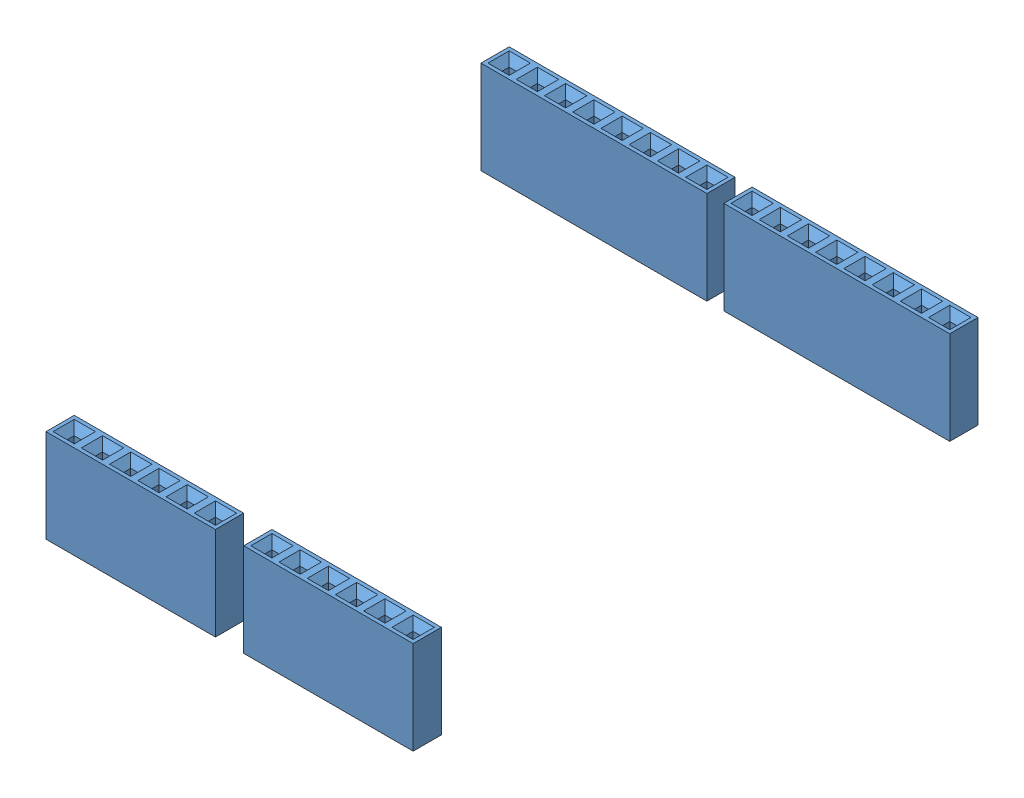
SolidWorks assembly SHIELD CONNECTORS.SLDASM, configuration Default (file format 4400). Lengths in mm.
Overall size (42.16 8.38 50.8).
4 component instances, 1 part files, 9 mates.
Components (placement in the parent):
- HEADER, FEMALE-1: HEADER, FEMALE.SLDPRT [6-pin] at (-26.747 22.2743 -1.8556) size (15.24 8.38 2.54)
- HEADER, FEMALE-2: HEADER, FEMALE.SLDPRT [6-pin] at (-44.527 22.2743 -1.8556) size (15.24 8.38 2.54)
- HEADER, FEMALE-3: HEADER, FEMALE.SLDPRT [8-pin] at (-48.591 22.2743 -50.1156) size (20.32 8.38 2.54)
- HEADER, FEMALE-4: HEADER, FEMALE.SLDPRT [8-pin] at (-26.747 22.2743 -50.1156) size (20.32 8.38 2.54)
Mates (geometry in assembly coordinates):
- Coincident1: coincident aligned: plane of HEADER, FEMALE-1 through (-28.017 22.2743 -3.1256) normal (0 -1 0); plane of HEADER, FEMALE-2 through (-45.797 22.2743 -3.1256) normal (0 -1 0)
- Coincident2: coincident aligned: plane of HEADER, FEMALE-1 through (-28.017 22.2743 -3.1256) normal (0 -1 0); plane of HEADER, FEMALE-3 through (-49.861 22.2743 -51.3856) normal (0 -1 0)
- Coincident3: coincident aligned: plane of HEADER, FEMALE-1 through (-28.017 22.2743 -3.1256) normal (0 -1 0); plane of HEADER, FEMALE-4 through (-28.017 22.2743 -51.3856) normal (0 -1 0)
- Coincident4: coincident aligned: plane of HEADER, FEMALE-1 through (-28.017 30.6563 -0.5856) normal (0 0 1); plane of HEADER, FEMALE-2 through (-45.797 30.6563 -0.5856) normal (0 0 1)
- Coincident5: coincident aligned: plane of HEADER, FEMALE-3 through (-49.861 30.6563 -48.8456) normal (0 0 1); plane of HEADER, FEMALE-4 through (-28.017 30.6563 -48.8456) normal (0 0 1)
- Coincident6: coincident aligned: plane of HEADER, FEMALE-1 through (-25.477 30.6563 -0.5856) normal (1 0 0); plane of HEADER, FEMALE-4 through (-25.477 30.6563 -48.8456) normal (1 0 0)
- Distance1: distance = 48.26 mm: point of HEADER, FEMALE-1; point of HEADER, FEMALE-4
- Distance2: distance = 2.54 mm anti-aligned: plane of HEADER, FEMALE-2 through (-43.257 30.6563 -0.5856) normal (1 0 0); plane of HEADER, FEMALE-1 through (-40.717 30.6563 -0.5856) normal (-1 0 0)
- Distance3: distance = 1.524 mm anti-aligned: plane of HEADER, FEMALE-3 through (-47.321 30.6563 -48.8456) normal (1 0 0); plane of HEADER, FEMALE-4 through (-45.797 30.6563 -48.8456) normal (-1 0 0)
